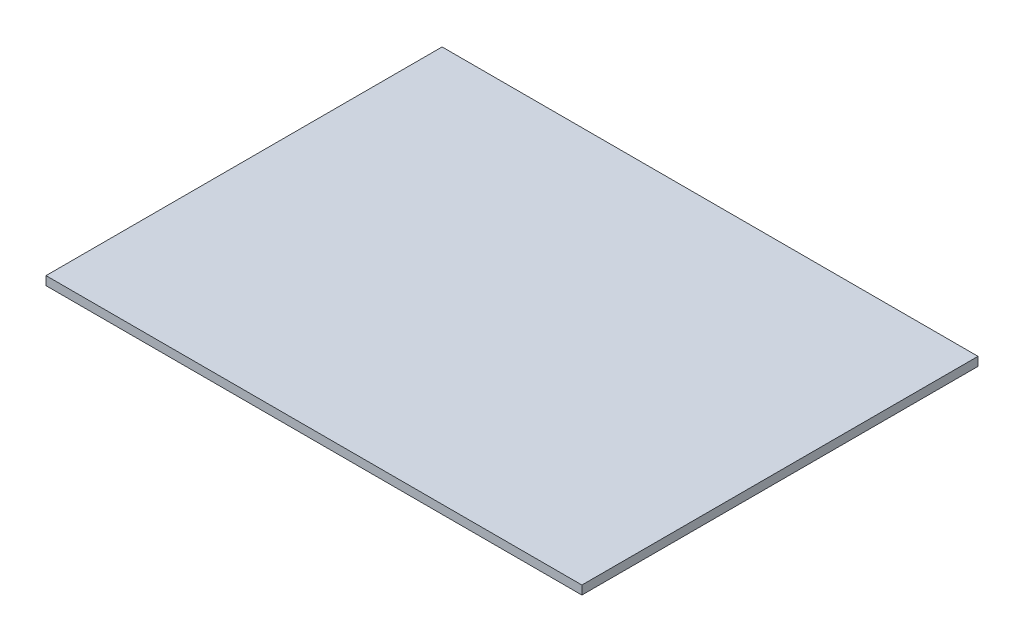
from build123d import *

# Parameters (mm, degrees)
SKETCH2_W           = 1168.4
SKETCH2_H           = 863.6
BOSS_EXTRUDE1_DEPTH = 19.05


with BuildPart() as part:
    # Sketch2 → Boss-Extrude1 (new body)
    with BuildSketch(Plane(origin=(0, 0, 0), x_dir=(1, 0, 0), z_dir=(0, 1, 0))):
        with Locations((584.2, 431.8)):
            Rectangle(SKETCH2_W, SKETCH2_H)
    extrude(amount=BOSS_EXTRUDE1_DEPTH)


solid = part.part
